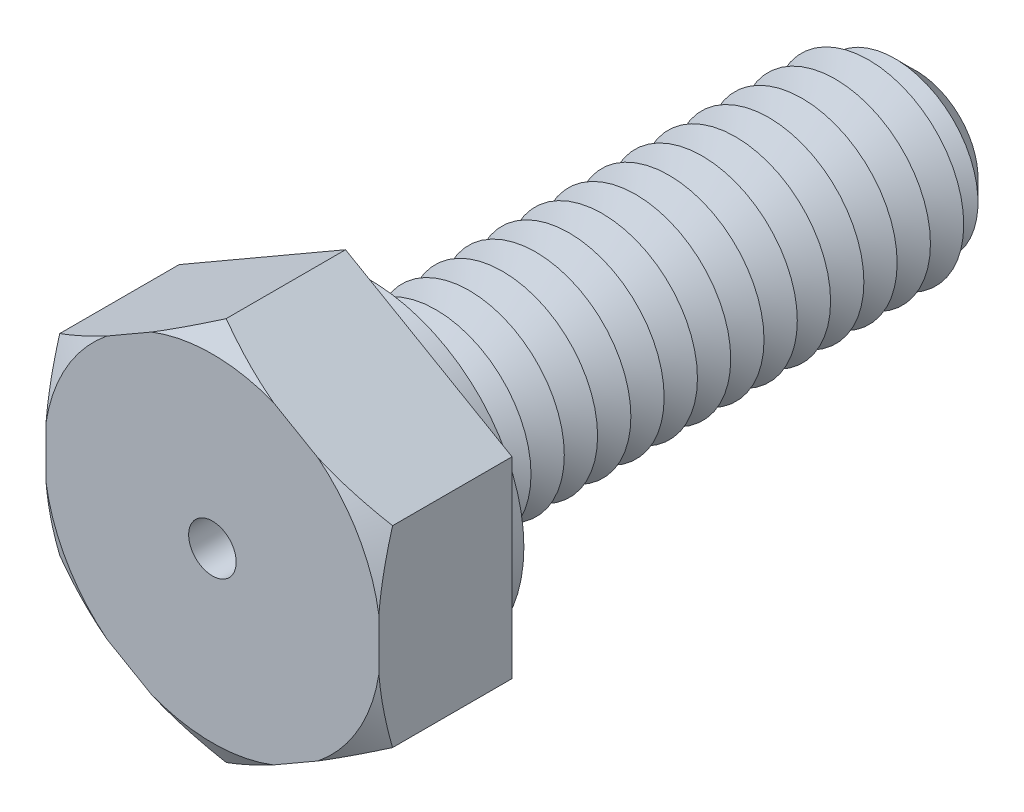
from build123d import *

# Parameters (mm, degrees)
BOSS_EXTRUDE1_DEPTH = 2.8
SKETCH3_R           = 2
BOSS_EXTRUDE2_DEPTH = 12
SKETCH4_R           = 3.25
BOSS_EXTRUDE3_DEPTH = 0.5
CHAMFER1_SIZE       = 0.7
LPATTERN1_COUNT     = 16
LPATTERN1_PITCH     = 0.7
SKETCH8_R           = 0.5
CUT_EXTRUDE1_DEPTH  = 14.8


with BuildPart() as part:
    # Sketch2 → Boss-Extrude1 (new body)
    with BuildSketch(Plane.XY):
        Polygon((0, 4.041451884), (-3.5, 2.020725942), (-3.5, -2.020725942), (0, -4.041451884), (3.5, -2.020725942), (3.5, 2.020725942), align=None)
    extrude(amount=BOSS_EXTRUDE1_DEPTH)

    # Sketch3 → Boss-Extrude2 (add)
    with BuildSketch(Plane(origin=(0, 0, 0), x_dir=(-1, 0, 0), z_dir=(0, 0, -1))):
        Circle(SKETCH3_R)
    extrude(amount=BOSS_EXTRUDE2_DEPTH)

    # Sketch4 → Boss-Extrude3 (add)
    with BuildSketch(Plane(origin=(0, 0, 0), x_dir=(-1, 0, 0), z_dir=(0, 0, -1))):
        with Locations(Location((0, 0, 0), (0, 0, 180))):
            Circle(SKETCH4_R)
    extrude(amount=BOSS_EXTRUDE3_DEPTH)

    # Chamfer1
    chamfer1_edges = [part.edges().sort_by_distance(p)[0] for p in [
        (2, 0, -12),
    ]]
    chamfer(chamfer1_edges, length=CHAMFER1_SIZE)

    # Sketch6 → Cut-Revolve1 (revolve, cut)
    with BuildSketch(Plane(origin=(0, 0, 0), x_dir=(0, 0, -1), z_dir=(1, 0, 0)), mode=Mode.PRIVATE) as cut_revolve1_sk:
        Polygon((0.5, 2), (0.85, 1.393782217), (1.2, 2), align=None)
    cut_revolve1 = revolve(cut_revolve1_sk.sketch.rotate(Axis((0, 0, 3.211670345), (0, 0, -1)), 90), axis=Axis((0, 0, 3.211670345), (0, 0, -1)), mode=Mode.SUBTRACT)

    # LPattern1: Cut-Revolve1 ×16
    with Locations(*[(0, 0, -i * LPATTERN1_PITCH) for i in range(1, LPATTERN1_COUNT)]):
        add(cut_revolve1, mode=Mode.SUBTRACT)

    # Sketch7 → Cut-Revolve2 (revolve, cut)
    with BuildSketch(Plane(origin=(0, 0, 0), x_dir=(0, 0, -1), z_dir=(1, 0, 0)), mode=Mode.PRIVATE) as cut_revolve2_sk:
        Polygon((-2.8, 4.041451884), (-2.8, 3.541451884), (-2.511324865, 4.041451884), align=None)
    revolve(cut_revolve2_sk.sketch.rotate(Axis((0, 0, 3.211670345), (0, 0, -1)), 270), axis=Axis((0, 0, 3.211670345), (0, 0, -1)), mode=Mode.SUBTRACT)

    # Sketch8 → Cut-Extrude1 (cut)
    with BuildSketch(Plane.XY.offset(2.8)):
        Circle(SKETCH8_R)
    extrude(amount=-CUT_EXTRUDE1_DEPTH, mode=Mode.SUBTRACT)


solid = part.part
